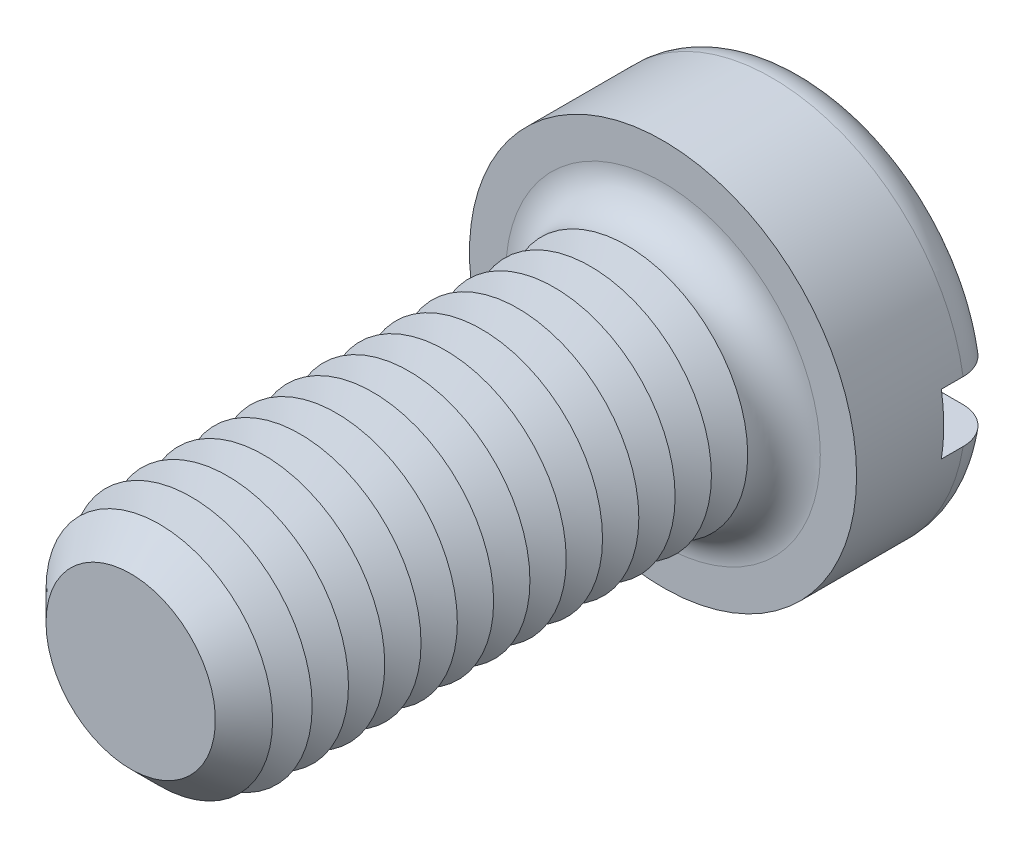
ISO-10303-21;
HEADER;
FILE_DESCRIPTION(('STEP AP214'),'2;1');
FILE_NAME('part.step','',(''),(''),'','','');
FILE_SCHEMA(('AUTOMOTIVE_DESIGN { 1 0 10303 214 1 1 1 1 }'));
ENDSEC;
DATA;
#1=APPLICATION_CONTEXT('core data for automotive mechanical design processes');
#2=APPLICATION_PROTOCOL_DEFINITION('international standard','automotive_design',2000,#1);
#3=PRODUCT_CONTEXT('',#1,'mechanical');
#4=PRODUCT('Part','Part','',(#3));
#5=PRODUCT_RELATED_PRODUCT_CATEGORY('part','',(#4));
#6=PRODUCT_DEFINITION_FORMATION('','',#4);
#7=PRODUCT_DEFINITION_CONTEXT('part definition',#1,'design');
#8=PRODUCT_DEFINITION('design','',#6,#7);
#9=PRODUCT_DEFINITION_SHAPE('','',#8);
#10=(LENGTH_UNIT() NAMED_UNIT(*) SI_UNIT(.MILLI.,.METRE.));
#11=(NAMED_UNIT(*) PLANE_ANGLE_UNIT() SI_UNIT($,.RADIAN.));
#12=(NAMED_UNIT(*) SI_UNIT($,.STERADIAN.) SOLID_ANGLE_UNIT());
#13=UNCERTAINTY_MEASURE_WITH_UNIT(LENGTH_MEASURE(1.E-05),#10,'distance_accuracy_value','');
#14=(GEOMETRIC_REPRESENTATION_CONTEXT(3) GLOBAL_UNCERTAINTY_ASSIGNED_CONTEXT((#13)) GLOBAL_UNIT_ASSIGNED_CONTEXT((#10,
#11,#12)) REPRESENTATION_CONTEXT('',''));
#15=CARTESIAN_POINT('',(0.,0.,0.));
#16=DIRECTION('',(0.,0.,1.));
#17=DIRECTION('',(1.,0.,0.));
#18=AXIS2_PLACEMENT_3D('',#15,#16,#17);
#19=CARTESIAN_POINT('',(0.,0.,-6.));
#20=DIRECTION('',(0.,0.,1.));
#21=DIRECTION('',(1.,0.,0.));
#22=AXIS2_PLACEMENT_3D('',#19,#20,#21);
#23=PLANE('',#22);
#24=CARTESIAN_POINT('',(0.,0.,-6.));
#25=DIRECTION('',(0.,0.,1.));
#26=DIRECTION('',(1.,0.,0.));
#27=AXIS2_PLACEMENT_3D('',#24,#25,#26);
#28=CIRCLE('',#27,6.5);
#29=CARTESIAN_POINT('',(-6.37867541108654,1.25,-6.));
#30=VERTEX_POINT('',#29);
#31=CARTESIAN_POINT('',(6.37867541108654,1.25,-6.));
#32=VERTEX_POINT('',#31);
#33=EDGE_CURVE('E116',#30,#32,#28,.F.);
#34=ORIENTED_EDGE('',*,*,#33,.T.);
#35=DIRECTION('',(1.,0.,0.));
#36=VECTOR('',#35,1.);
#37=CARTESIAN_POINT('',(-8.,1.25,-6.));
#38=LINE('',#37,#36);
#39=EDGE_CURVE('E111',#30,#32,#38,.T.);
#40=ORIENTED_EDGE('',*,*,#39,.F.);
#41=EDGE_LOOP('',(#34,#40));
#42=FACE_BOUND('',#41,.T.);
#43=ADVANCED_FACE('F39',(#42),#23,.F.);
#44=CARTESIAN_POINT('',(0.,0.,-4.5));
#45=DIRECTION('',(0.,0.,1.));
#46=DIRECTION('',(1.,0.,0.));
#47=AXIS2_PLACEMENT_3D('',#44,#45,#46);
#48=TOROIDAL_SURFACE('',#47,6.5,1.5);
#49=CARTESIAN_POINT('',(-7.63778128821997,1.25,-5.34492908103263));
#50=CARTESIAN_POINT('',(-7.58949199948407,1.25,-5.41482553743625));
#51=CARTESIAN_POINT('',(-7.53520056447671,1.25,-5.48065698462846));
#52=CARTESIAN_POINT('',(-7.41624971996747,1.25,-5.60228223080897));
#53=CARTESIAN_POINT('',(-7.35157642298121,1.25,-5.65806236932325));
#54=CARTESIAN_POINT('',(-7.21387612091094,1.25,-5.75795436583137));
#55=CARTESIAN_POINT('',(-7.14085828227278,1.25,-5.80207885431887));
#56=CARTESIAN_POINT('',(-6.98853766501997,1.25,-5.87758013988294));
#57=CARTESIAN_POINT('',(-6.90923642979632,1.25,-5.90896005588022));
#58=CARTESIAN_POINT('',(-6.74565677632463,1.25,-5.95849861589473));
#59=CARTESIAN_POINT('',(-6.66133328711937,1.25,-5.97650838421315));
#60=CARTESIAN_POINT('',(-6.49086565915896,1.25,-5.99833509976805));
#61=CARTESIAN_POINT('',(-6.40472129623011,1.25,-6.00215028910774));
#62=CARTESIAN_POINT('',(-6.23174891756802,1.25,-5.99550457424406));
#63=CARTESIAN_POINT('',(-6.14492874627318,1.25,-5.98483870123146));
#64=CARTESIAN_POINT('',(-5.97427268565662,1.25,-5.94920077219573));
#65=CARTESIAN_POINT('',(-5.89043699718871,1.25,-5.92422775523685));
#66=CARTESIAN_POINT('',(-5.72747580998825,1.25,-5.86041051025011));
#67=CARTESIAN_POINT('',(-5.64839123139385,1.25,-5.8214616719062));
#68=CARTESIAN_POINT('',(-5.49793182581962,1.25,-5.73076137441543));
#69=CARTESIAN_POINT('',(-5.42655700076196,1.25,-5.6790099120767));
#70=CARTESIAN_POINT('',(-5.29410028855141,1.25,-5.56444713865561));
#71=CARTESIAN_POINT('',(-5.23295591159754,1.25,-5.50170815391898));
#72=CARTESIAN_POINT('',(-5.12236155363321,1.25,-5.36664720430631));
#73=CARTESIAN_POINT('',(-5.07291010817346,1.25,-5.29432644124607));
#74=CARTESIAN_POINT('',(-4.98836421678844,1.25,-5.14389152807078));
#75=CARTESIAN_POINT('',(-4.95296843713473,1.25,-5.0659468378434));
#76=CARTESIAN_POINT('',(-4.89620356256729,1.25,-4.90510804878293));
#77=CARTESIAN_POINT('',(-4.87483169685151,1.25,-4.82221493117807));
#78=CARTESIAN_POINT('',(-4.8472995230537,1.25,-4.65636387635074));
#79=CARTESIAN_POINT('',(-4.84072446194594,1.25,-4.57347463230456));
#80=CARTESIAN_POINT('',(-4.84179430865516,1.25,-4.40779255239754));
#81=CARTESIAN_POINT('',(-4.84943782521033,1.25,-4.32499970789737));
#82=CARTESIAN_POINT('',(-4.87846819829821,1.25,-4.16301415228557));
#83=CARTESIAN_POINT('',(-4.89966978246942,1.25,-4.08378809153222));
#84=CARTESIAN_POINT('',(-4.95491528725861,1.25,-3.92995334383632));
#85=CARTESIAN_POINT('',(-4.98895983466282,1.25,-3.85534488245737));
#86=CARTESIAN_POINT('',(-5.06928242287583,1.25,-3.71183790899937));
#87=CARTESIAN_POINT('',(-5.11570495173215,1.25,-3.64302036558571));
#88=CARTESIAN_POINT('',(-5.21915370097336,1.25,-3.51388372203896));
#89=CARTESIAN_POINT('',(-5.27618132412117,1.25,-3.45356574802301));
#90=CARTESIAN_POINT('',(-5.40090076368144,1.25,-3.34137671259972));
#91=CARTESIAN_POINT('',(-5.46884305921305,1.25,-3.28978408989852));
#92=CARTESIAN_POINT('',(-5.61225757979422,1.25,-3.19841811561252));
#93=CARTESIAN_POINT('',(-5.68773079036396,1.25,-3.15864631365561));
#94=CARTESIAN_POINT('',(-5.84602026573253,1.25,-3.09111626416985));
#95=CARTESIAN_POINT('',(-5.92896901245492,1.25,-3.06366820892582));
#96=CARTESIAN_POINT('',(-6.09827849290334,1.25,-3.02294686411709));
#97=CARTESIAN_POINT('',(-6.18463944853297,1.25,-3.00967449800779));
#98=CARTESIAN_POINT('',(-6.35914138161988,1.25,-2.99765063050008));
#99=CARTESIAN_POINT('',(-6.4472913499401,1.25,-2.99902877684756));
#100=CARTESIAN_POINT('',(-6.62209547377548,1.25,-3.01665363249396));
#101=CARTESIAN_POINT('',(-6.70874965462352,1.25,-3.03290008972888));
#102=CARTESIAN_POINT('',(-6.87754008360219,1.25,-3.07975247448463));
#103=CARTESIAN_POINT('',(-6.95969991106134,1.25,-3.11027336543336));
#104=CARTESIAN_POINT('',(-7.11762200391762,1.25,-3.18486653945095));
#105=CARTESIAN_POINT('',(-7.19338469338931,1.25,-3.22893792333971));
#106=CARTESIAN_POINT('',(-7.33522754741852,1.25,-3.32873457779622));
#107=CARTESIAN_POINT('',(-7.40142768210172,1.25,-3.38428930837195));
#108=CARTESIAN_POINT('',(-7.52338344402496,1.25,-3.50587739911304));
#109=CARTESIAN_POINT('',(-7.5791399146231,1.25,-3.57190991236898));
#110=CARTESIAN_POINT('',(-7.67774856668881,1.25,-3.71151097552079));
#111=CARTESIAN_POINT('',(-7.72078137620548,1.25,-3.7849519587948));
#112=CARTESIAN_POINT('',(-7.79373860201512,1.25,-3.93807617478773));
#113=CARTESIAN_POINT('',(-7.82366445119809,1.25,-4.01775872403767));
#114=CARTESIAN_POINT('',(-7.86922494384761,1.25,-4.1801114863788));
#115=CARTESIAN_POINT('',(-7.88502105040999,1.25,-4.26273642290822));
#116=CARTESIAN_POINT('',(-7.90243332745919,1.25,-4.42948977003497));
#117=CARTESIAN_POINT('',(-7.90404643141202,1.25,-4.51361850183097));
#118=CARTESIAN_POINT('',(-7.89306914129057,1.25,-4.68049925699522));
#119=CARTESIAN_POINT('',(-7.88055163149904,1.25,-4.76325613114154));
#120=CARTESIAN_POINT('',(-7.84181179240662,1.25,-4.92542124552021));
#121=CARTESIAN_POINT('',(-7.81560657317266,1.25,-5.00483353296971));
#122=CARTESIAN_POINT('',(-7.76329893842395,1.25,-5.12766777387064));
#123=CARTESIAN_POINT('',(-7.74127773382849,1.25,-5.17287245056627));
#124=CARTESIAN_POINT('',(-7.69279783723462,1.25,-5.26083500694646));
#125=CARTESIAN_POINT('',(-7.66633917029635,1.25,-5.30359290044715));
#126=CARTESIAN_POINT('',(-7.63778128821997,1.25,-5.34492908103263));
#127=B_SPLINE_CURVE_WITH_KNOTS('',3,(#49,#50,#51,#52,#53,#54,#55,#56,#57,#58,#59,#60,#61,#62,
#63,#64,#65,#66,#67,#68,#69,#70,#71,#72,#73,#74,#75,#76,#77,#78,#79,#80,#81,#82,#83,#84,#85,#86,
#87,#88,#89,#90,#91,#92,#93,#94,#95,#96,#97,#98,#99,#100,#101,#102,#103,#104,#105,#106,#107,
#108,#109,#110,#111,#112,#113,#114,#115,#116,#117,#118,#119,#120,#121,#122,#123,#124,#125,#126),
.UNSPECIFIED.,.T.,.F.,(4,2,2,2,2,2,2,2,2,2,2,2,2,2,2,2,2,2,2,2,2,2,2,2,2,2,2,2,2,2,2,2,2,2,2,2,
2,2,4),(0.,0.254678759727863,0.509701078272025,0.764445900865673,1.01912834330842,
1.27660578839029,1.53411511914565,1.7953075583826,2.05651754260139,2.31972495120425,
2.58293242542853,2.84446831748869,3.10597143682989,3.36151874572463,3.61701554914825,
3.86525656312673,4.11347328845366,4.35836855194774,4.60327576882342,4.8511774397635,
5.0991119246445,5.35387584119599,5.60867314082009,5.86956650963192,6.13047687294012,
6.39369803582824,6.65691473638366,6.91858297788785,7.18023385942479,7.43824706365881,
7.69623942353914,7.95037087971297,8.20447454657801,8.45563599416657,8.70685174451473,
8.95677764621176,9.20639187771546,9.35700761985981,9.50762251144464),.UNSPECIFIED.);
#128=CARTESIAN_POINT('',(-7.90174031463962,1.25,-4.50000000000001));
#129=VERTEX_POINT('',#128);
#130=EDGE_CURVE('E289',#129,#30,#127,.T.);
#131=ORIENTED_EDGE('',*,*,#130,.F.);
#132=CARTESIAN_POINT('',(0.,0.,-4.5));
#133=DIRECTION('',(0.,0.,1.));
#134=DIRECTION('',(1.,0.,0.));
#135=AXIS2_PLACEMENT_3D('',#132,#133,#134);
#136=CIRCLE('',#135,8.);
#137=CARTESIAN_POINT('',(7.90174031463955,1.25,-4.5));
#138=VERTEX_POINT('',#137);
#139=EDGE_CURVE('E125',#138,#129,#136,.T.);
#140=ORIENTED_EDGE('',*,*,#139,.F.);
#141=CARTESIAN_POINT('',(4.95236709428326,1.25,-5.05808354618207));
#142=CARTESIAN_POINT('',(4.98477386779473,1.25,-5.13646278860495));
#143=CARTESIAN_POINT('',(5.02397623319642,1.25,-5.21210974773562));
#144=CARTESIAN_POINT('',(5.11464829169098,1.25,-5.35575180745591));
#145=CARTESIAN_POINT('',(5.16613670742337,1.25,-5.42373499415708));
#146=CARTESIAN_POINT('',(5.27963080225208,1.25,-5.55005899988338));
#147=CARTESIAN_POINT('',(5.34161871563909,1.25,-5.60841578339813));
#148=CARTESIAN_POINT('',(5.47431803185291,1.25,-5.71412381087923));
#149=CARTESIAN_POINT('',(5.545027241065,1.25,-5.76147781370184));
#150=CARTESIAN_POINT('',(5.69469818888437,1.25,-5.84486022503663));
#151=CARTESIAN_POINT('',(5.77379661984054,1.25,-5.88064336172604));
#152=CARTESIAN_POINT('',(5.93682776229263,1.25,-5.93863952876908));
#153=CARTESIAN_POINT('',(6.02076112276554,1.25,-5.96085073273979));
#154=CARTESIAN_POINT('',(6.19235911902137,1.25,-5.99130732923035));
#155=CARTESIAN_POINT('',(6.2800597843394,1.25,-5.99935025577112));
#156=CARTESIAN_POINT('',(6.45556807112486,1.25,-6.00057400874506));
#157=CARTESIAN_POINT('',(6.54337569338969,1.25,-5.99375472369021));
#158=CARTESIAN_POINT('',(6.71642471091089,1.25,-5.96539034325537));
#159=CARTESIAN_POINT('',(6.8016703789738,1.25,-5.94387137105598));
#160=CARTESIAN_POINT('',(6.96726399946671,1.25,-5.8866508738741));
#161=CARTESIAN_POINT('',(7.04761223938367,1.25,-5.85095018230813));
#162=CARTESIAN_POINT('',(7.2000703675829,1.25,-5.7668235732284));
#163=CARTESIAN_POINT('',(7.27226868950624,1.25,-5.71855796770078));
#164=CARTESIAN_POINT('',(7.40737382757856,1.25,-5.61041520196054));
#165=CARTESIAN_POINT('',(7.47028138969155,1.25,-5.55053897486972));
#166=CARTESIAN_POINT('',(7.5840004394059,1.25,-5.42185995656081));
#167=CARTESIAN_POINT('',(7.63498189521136,1.25,-5.35320736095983));
#168=CARTESIAN_POINT('',(7.72451646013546,1.25,-5.20822613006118));
#169=CARTESIAN_POINT('',(7.76307051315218,1.25,-5.13189807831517));
#170=CARTESIAN_POINT('',(7.82615156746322,1.25,-4.97479919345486));
#171=CARTESIAN_POINT('',(7.85085353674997,1.25,-4.89409858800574));
#172=CARTESIAN_POINT('',(7.88624162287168,1.25,-4.72968126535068));
#173=CARTESIAN_POINT('',(7.89692844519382,1.25,-4.64596470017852));
#174=CARTESIAN_POINT('',(7.90393395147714,1.25,-4.47857496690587));
#175=CARTESIAN_POINT('',(7.900361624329,1.25,-4.39490633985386));
#176=CARTESIAN_POINT('',(7.8792027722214,1.25,-4.22936201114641));
#177=CARTESIAN_POINT('',(7.86161649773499,1.25,-4.14748627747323));
#178=CARTESIAN_POINT('',(7.81298565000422,1.25,-3.98793539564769));
#179=CARTESIAN_POINT('',(7.78195585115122,1.25,-3.91025574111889));
#180=CARTESIAN_POINT('',(7.70736418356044,1.25,-3.76116938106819));
#181=CARTESIAN_POINT('',(7.66380211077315,1.25,-3.68976277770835));
#182=CARTESIAN_POINT('',(7.56515173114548,1.25,-3.55480889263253));
#183=CARTESIAN_POINT('',(7.51000119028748,1.25,-3.49130712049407));
#184=CARTESIAN_POINT('',(7.38992820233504,1.25,-3.3743390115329));
#185=CARTESIAN_POINT('',(7.32500529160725,1.25,-3.32087315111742));
#186=CARTESIAN_POINT('',(7.18646521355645,1.25,-3.22483712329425));
#187=CARTESIAN_POINT('',(7.11275872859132,1.25,-3.18239583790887));
#188=CARTESIAN_POINT('',(6.95934489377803,1.25,-3.11028530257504));
#189=CARTESIAN_POINT('',(6.87963710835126,1.25,-3.08061698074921));
#190=CARTESIAN_POINT('',(6.71523243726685,1.25,-3.03442872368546));
#191=CARTESIAN_POINT('',(6.63047940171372,1.25,-3.0181086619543));
#192=CARTESIAN_POINT('',(6.45944163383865,1.25,-2.99971307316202));
#193=CARTESIAN_POINT('',(6.37315677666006,1.25,-2.99763871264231));
#194=CARTESIAN_POINT('',(6.20021063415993,1.25,-3.00779604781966));
#195=CARTESIAN_POINT('',(6.11356117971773,1.25,-3.02022976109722));
#196=CARTESIAN_POINT('',(5.94354092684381,1.25,-3.05935975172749));
#197=CARTESIAN_POINT('',(5.86017035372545,1.25,-3.08605700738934));
#198=CARTESIAN_POINT('',(5.69848536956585,1.25,-3.15322746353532));
#199=CARTESIAN_POINT('',(5.62021039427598,1.25,-3.1937956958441));
#200=CARTESIAN_POINT('',(5.47164170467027,1.25,-3.28758816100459));
#201=CARTESIAN_POINT('',(5.40134797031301,1.25,-3.3408123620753));
#202=CARTESIAN_POINT('',(5.27136483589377,1.25,-3.45806317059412));
#203=CARTESIAN_POINT('',(5.21160120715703,1.25,-3.52200740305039));
#204=CARTESIAN_POINT('',(5.10396941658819,1.25,-3.65922833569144));
#205=CARTESIAN_POINT('',(5.05609917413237,1.25,-3.73250340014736));
#206=CARTESIAN_POINT('',(4.97487058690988,1.25,-3.8844714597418));
#207=CARTESIAN_POINT('',(4.94119529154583,1.25,-3.96299495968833));
#208=CARTESIAN_POINT('',(4.88793322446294,1.25,-4.12470694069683));
#209=CARTESIAN_POINT('',(4.86834741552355,1.25,-4.20789574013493));
#210=CARTESIAN_POINT('',(4.84433446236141,1.25,-4.3740749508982));
#211=CARTESIAN_POINT('',(4.83950391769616,1.25,-4.45700748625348));
#212=CARTESIAN_POINT('',(4.84404021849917,1.25,-4.62240731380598));
#213=CARTESIAN_POINT('',(4.85338770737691,1.25,-4.70487508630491));
#214=CARTESIAN_POINT('',(4.87895619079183,1.25,-4.83246978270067));
#215=CARTESIAN_POINT('',(4.89056704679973,1.25,-4.87856970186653));
#216=CARTESIAN_POINT('',(4.91819711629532,1.25,-4.96942661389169));
#217=CARTESIAN_POINT('',(4.93421619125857,1.25,-5.01418364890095));
#218=CARTESIAN_POINT('',(4.95236709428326,1.25,-5.05808354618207));
#219=B_SPLINE_CURVE_WITH_KNOTS('',3,(#141,#142,#143,#144,#145,#146,#147,#148,#149,#150,#151,
#152,#153,#154,#155,#156,#157,#158,#159,#160,#161,#162,#163,#164,#165,#166,#167,#168,#169,#170,
#171,#172,#173,#174,#175,#176,#177,#178,#179,#180,#181,#182,#183,#184,#185,#186,#187,#188,#189,
#190,#191,#192,#193,#194,#195,#196,#197,#198,#199,#200,#201,#202,#203,#204,#205,#206,#207,#208,
#209,#210,#211,#212,#213,#214,#215,#216,#217,#218),.UNSPECIFIED.,.T.,.F.,(4,2,2,2,2,2,2,2,2,2,2,
2,2,2,2,2,2,2,2,2,2,2,2,2,2,2,2,2,2,2,2,2,2,2,2,2,2,2,4),(0.,0.25426396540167,0.508917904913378,
0.763145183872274,1.01730864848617,1.27655188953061,1.53583000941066,1.79878406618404,
2.06174009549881,2.32423003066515,2.5867045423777,2.84598168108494,3.10523799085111,
3.36053725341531,3.61581712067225,3.8677953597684,4.11976091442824,4.36980428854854,
4.61984319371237,4.86960800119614,5.11937687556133,5.37052303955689,5.62168112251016,
5.87565515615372,6.12964764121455,6.38737709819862,6.64512765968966,6.90651052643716,
7.16791132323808,7.43114013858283,7.69436829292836,7.95565940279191,8.21690477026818,
8.47196060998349,8.72703387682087,8.97506819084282,9.22276418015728,9.36518087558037,
9.50759309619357),.UNSPECIFIED.);
#220=EDGE_CURVE('E291',#32,#138,#219,.T.);
#221=ORIENTED_EDGE('',*,*,#220,.F.);
#222=ORIENTED_EDGE('',*,*,#33,.F.);
#223=EDGE_LOOP('',(#131,#140,#221,#222));
#224=FACE_BOUND('',#223,.T.);
#225=ADVANCED_FACE('F273',(#224),#48,.T.);
#226=CARTESIAN_POINT('',(0.,0.,-6.));
#227=DIRECTION('',(0.,0.,1.));
#228=DIRECTION('',(1.,0.,0.));
#229=AXIS2_PLACEMENT_3D('',#226,#227,#228);
#230=CYLINDRICAL_SURFACE('',#229,8.);
#231=DIRECTION('',(0.,0.,1.));
#232=VECTOR('',#231,1.);
#233=CARTESIAN_POINT('',(7.90174031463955,1.25,-6.));
#234=LINE('',#233,#232);
#235=CARTESIAN_POINT('',(7.90174031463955,1.25,-3.6));
#236=VERTEX_POINT('',#235);
#237=EDGE_CURVE('E307',#138,#236,#234,.T.);
#238=ORIENTED_EDGE('',*,*,#237,.F.);
#239=ORIENTED_EDGE('',*,*,#139,.T.);
#240=DIRECTION('',(0.,0.,1.));
#241=VECTOR('',#240,1.);
#242=CARTESIAN_POINT('',(-7.90174031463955,1.25,-6.));
#243=LINE('',#242,#241);
#244=CARTESIAN_POINT('',(-7.90174031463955,1.25,-3.6));
#245=VERTEX_POINT('',#244);
#246=EDGE_CURVE('E63',#245,#129,#243,.F.);
#247=ORIENTED_EDGE('',*,*,#246,.F.);
#248=CARTESIAN_POINT('',(0.,0.,-3.6));
#249=DIRECTION('',(0.,0.,-1.));
#250=DIRECTION('',(-1.,0.,0.));
#251=AXIS2_PLACEMENT_3D('',#248,#249,#250);
#252=CIRCLE('',#251,8.);
#253=CARTESIAN_POINT('',(-7.90174031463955,-1.25,-3.6));
#254=VERTEX_POINT('',#253);
#255=EDGE_CURVE('E43',#245,#254,#252,.F.);
#256=ORIENTED_EDGE('',*,*,#255,.T.);
#257=DIRECTION('',(0.,0.,1.));
#258=VECTOR('',#257,1.);
#259=CARTESIAN_POINT('',(-7.90174031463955,-1.25,-6.));
#260=LINE('',#259,#258);
#261=CARTESIAN_POINT('',(-7.9017403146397,-1.25,-4.49999999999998));
#262=VERTEX_POINT('',#261);
#263=EDGE_CURVE('E304',#262,#254,#260,.T.);
#264=ORIENTED_EDGE('',*,*,#263,.F.);
#265=CARTESIAN_POINT('',(7.90174031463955,-1.25,-4.5));
#266=VERTEX_POINT('',#265);
#267=EDGE_CURVE('E127',#262,#266,#136,.T.);
#268=ORIENTED_EDGE('',*,*,#267,.T.);
#269=DIRECTION('',(0.,0.,1.));
#270=VECTOR('',#269,1.);
#271=CARTESIAN_POINT('',(7.90174031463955,-1.25,-6.));
#272=LINE('',#271,#270);
#273=CARTESIAN_POINT('',(7.90174031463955,-1.25,-3.6));
#274=VERTEX_POINT('',#273);
#275=EDGE_CURVE('E55',#274,#266,#272,.F.);
#276=ORIENTED_EDGE('',*,*,#275,.F.);
#277=EDGE_CURVE('E11',#274,#236,#252,.F.);
#278=ORIENTED_EDGE('',*,*,#277,.T.);
#279=EDGE_LOOP('',(#238,#239,#247,#256,#264,#268,#276,#278));
#280=FACE_BOUND('',#279,.T.);
#281=CARTESIAN_POINT('',(0.,0.,0.));
#282=DIRECTION('',(0.,0.,1.));
#283=DIRECTION('',(1.,0.,0.));
#284=AXIS2_PLACEMENT_3D('',#281,#282,#283);
#285=CIRCLE('',#284,8.);
#286=CARTESIAN_POINT('',(8.,0.,0.));
#287=VERTEX_POINT('',#286);
#288=EDGE_CURVE('E310',#287,#287,#285,.T.);
#289=ORIENTED_EDGE('',*,*,#288,.F.);
#290=EDGE_LOOP('',(#289));
#291=FACE_BOUND('',#290,.T.);
#292=ADVANCED_FACE('F269',(#280,#291),#230,.T.);
#293=CARTESIAN_POINT('',(6.37867541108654,-1.25,-6.));
#294=VERTEX_POINT('',#293);
#295=CARTESIAN_POINT('',(-6.37867541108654,-1.25,-6.));
#296=VERTEX_POINT('',#295);
#297=EDGE_CURVE('E109',#294,#296,#28,.F.);
#298=ORIENTED_EDGE('',*,*,#297,.T.);
#299=DIRECTION('',(-1.,0.,0.));
#300=VECTOR('',#299,1.);
#301=CARTESIAN_POINT('',(-8.,-1.25,-6.));
#302=LINE('',#301,#300);
#303=EDGE_CURVE('E96',#294,#296,#302,.T.);
#304=ORIENTED_EDGE('',*,*,#303,.F.);
#305=EDGE_LOOP('',(#298,#304));
#306=FACE_BOUND('',#305,.T.);
#307=ADVANCED_FACE('F108',(#306),#23,.F.);
#308=CARTESIAN_POINT('',(0.,0.,0.));
#309=DIRECTION('',(0.,0.,1.));
#310=DIRECTION('',(1.,0.,0.));
#311=AXIS2_PLACEMENT_3D('',#308,#309,#310);
#312=PLANE('',#311);
#313=CARTESIAN_POINT('',(0.,0.,0.));
#314=DIRECTION('',(0.,0.,1.));
#315=DIRECTION('',(1.,0.,0.));
#316=AXIS2_PLACEMENT_3D('',#313,#314,#315);
#317=CIRCLE('',#316,6.5);
#318=CARTESIAN_POINT('',(6.5,0.,0.));
#319=VERTEX_POINT('',#318);
#320=EDGE_CURVE('E115',#319,#319,#317,.F.);
#321=ORIENTED_EDGE('',*,*,#320,.T.);
#322=EDGE_LOOP('',(#321));
#323=FACE_BOUND('',#322,.T.);
#324=ORIENTED_EDGE('',*,*,#288,.T.);
#325=EDGE_LOOP('',(#324));
#326=FACE_BOUND('',#325,.T.);
#327=ADVANCED_FACE('F268',(#323,#326),#312,.T.);
#328=CARTESIAN_POINT('',(-7.63778128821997,-1.25,-5.34492908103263));
#329=CARTESIAN_POINT('',(-7.68527581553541,-1.25,-5.27616964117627));
#330=CARTESIAN_POINT('',(-7.72703224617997,-1.25,-5.20337764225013));
#331=CARTESIAN_POINT('',(-7.79778035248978,-1.25,-5.05176511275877));
#332=CARTESIAN_POINT('',(-7.82675823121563,-1.25,-4.97293817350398));
#333=CARTESIAN_POINT('',(-7.87103239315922,-1.25,-4.81153865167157));
#334=CARTESIAN_POINT('',(-7.8863313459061,-1.25,-4.72896680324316));
#335=CARTESIAN_POINT('',(-7.90278562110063,-1.25,-4.56244566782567));
#336=CARTESIAN_POINT('',(-7.90394420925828,-1.25,-4.4784967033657));
#337=CARTESIAN_POINT('',(-7.89211470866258,-1.25,-4.31190980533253));
#338=CARTESIAN_POINT('',(-7.87917806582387,-1.25,-4.22926821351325));
#339=CARTESIAN_POINT('',(-7.8396278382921,-1.25,-4.06732477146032));
#340=CARTESIAN_POINT('',(-7.81301388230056,-1.25,-3.98802301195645));
#341=CARTESIAN_POINT('',(-7.74686575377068,-1.25,-3.83490116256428));
#342=CARTESIAN_POINT('',(-7.70731700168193,-1.25,-3.76108737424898));
#343=CARTESIAN_POINT('',(-7.61647675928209,-1.25,-3.62108231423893));
#344=CARTESIAN_POINT('',(-7.56518496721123,-1.25,-3.55489123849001));
#345=CARTESIAN_POINT('',(-7.45192141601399,-1.25,-3.43145488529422));
#346=CARTESIAN_POINT('',(-7.3898717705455,-1.25,-3.37428109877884));
#347=CARTESIAN_POINT('',(-7.25715883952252,-1.25,-3.27100737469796));
#348=CARTESIAN_POINT('',(-7.18649507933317,-1.25,-3.22490804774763));
#349=CARTESIAN_POINT('',(-7.03760898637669,-1.25,-3.14445316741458));
#350=CARTESIAN_POINT('',(-6.95930204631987,-1.25,-3.1102542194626));
#351=CARTESIAN_POINT('',(-6.79811453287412,-1.25,-3.05526915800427));
#352=CARTESIAN_POINT('',(-6.71523359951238,-1.25,-3.03448410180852));
#353=CARTESIAN_POINT('',(-6.5459165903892,-1.25,-3.006592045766));
#354=CARTESIAN_POINT('',(-6.45944575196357,-1.25,-2.99969602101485));
#355=CARTESIAN_POINT('',(-6.28655568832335,-1.25,-3.00032465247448));
#356=CARTESIAN_POINT('',(-6.20013646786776,-1.25,-3.00785047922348));
#357=CARTESIAN_POINT('',(-6.02865505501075,-1.25,-3.03725742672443));
#358=CARTESIAN_POINT('',(-5.94362352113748,-1.25,-3.05931758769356));
#359=CARTESIAN_POINT('',(-5.77844448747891,-1.25,-3.11735373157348));
#360=CARTESIAN_POINT('',(-5.69829723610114,-1.25,-3.15333042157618));
#361=CARTESIAN_POINT('',(-5.54495924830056,-1.25,-3.23837037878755));
#362=CARTESIAN_POINT('',(-5.47178958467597,-1.25,-3.28747168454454));
#363=CARTESIAN_POINT('',(-5.33486536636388,-1.25,-3.39741183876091));
#364=CARTESIAN_POINT('',(-5.27111040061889,-1.25,-3.45825017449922));
#365=CARTESIAN_POINT('',(-5.15579778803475,-1.25,-3.58914722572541));
#366=CARTESIAN_POINT('',(-5.10409113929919,-1.25,-3.65907455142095));
#367=CARTESIAN_POINT('',(-5.01353659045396,-1.25,-3.8068142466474));
#368=CARTESIAN_POINT('',(-4.97468647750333,-1.25,-3.88462525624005));
#369=CARTESIAN_POINT('',(-4.91208858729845,-1.25,-4.04366636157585));
#370=CARTESIAN_POINT('',(-4.88795969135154,-1.25,-4.12474643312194));
#371=CARTESIAN_POINT('',(-4.85404909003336,-1.25,-4.28985038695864));
#372=CARTESIAN_POINT('',(-4.84426486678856,-1.25,-4.37387374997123));
#373=CARTESIAN_POINT('',(-4.83946276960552,-1.25,-4.54023897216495));
#374=CARTESIAN_POINT('',(-4.8440833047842,-1.25,-4.62257060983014));
#375=CARTESIAN_POINT('',(-4.86713763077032,-1.25,-4.78527148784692));
#376=CARTESIAN_POINT('',(-4.88557092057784,-1.25,-4.86564079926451));
#377=CARTESIAN_POINT('',(-4.9355229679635,-1.25,-5.02189555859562));
#378=CARTESIAN_POINT('',(-4.9669975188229,-1.25,-5.09779517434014));
#379=CARTESIAN_POINT('',(-5.04199393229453,-1.25,-5.24338322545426));
#380=CARTESIAN_POINT('',(-5.0855168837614,-1.25,-5.31307109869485));
#381=CARTESIAN_POINT('',(-5.18427540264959,-1.25,-5.44580979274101));
#382=CARTESIAN_POINT('',(-5.2397318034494,-1.25,-5.50869620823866));
#383=CARTESIAN_POINT('',(-5.36015301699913,-1.25,-5.62458635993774));
#384=CARTESIAN_POINT('',(-5.42511919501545,-1.25,-5.67758867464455));
#385=CARTESIAN_POINT('',(-5.56469412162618,-1.25,-5.7737610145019));
#386=CARTESIAN_POINT('',(-5.6395232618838,-1.25,-5.81661133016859));
#387=CARTESIAN_POINT('',(-5.79521544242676,-1.25,-5.8894110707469));
#388=CARTESIAN_POINT('',(-5.8760791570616,-1.25,-5.91935905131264));
#389=CARTESIAN_POINT('',(-6.04317815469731,-1.25,-5.9660059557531));
#390=CARTESIAN_POINT('',(-6.12948555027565,-1.25,-5.98244700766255));
#391=CARTESIAN_POINT('',(-6.30363462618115,-1.25,-6.00064866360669));
#392=CARTESIAN_POINT('',(-6.39147629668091,-1.25,-6.00240936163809));
#393=CARTESIAN_POINT('',(-6.5664192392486,-1.25,-5.9911248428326));
#394=CARTESIAN_POINT('',(-6.653518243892,-1.25,-5.9780442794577));
#395=CARTESIAN_POINT('',(-6.82426167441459,-1.25,-5.93729204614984));
#396=CARTESIAN_POINT('',(-6.90790538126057,-1.25,-5.90961735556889));
#397=CARTESIAN_POINT('',(-7.06846412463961,-1.25,-5.84071272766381));
#398=CARTESIAN_POINT('',(-7.14543542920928,-1.25,-5.79961377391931));
#399=CARTESIAN_POINT('',(-7.29116896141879,-1.25,-5.70491210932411));
#400=CARTESIAN_POINT('',(-7.35994165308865,-1.25,-5.65132560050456));
#401=CARTESIAN_POINT('',(-7.46362894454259,-1.25,-5.55509815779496));
#402=CARTESIAN_POINT('',(-7.50165191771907,-1.25,-5.51575032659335));
#403=CARTESIAN_POINT('',(-7.57319530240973,-1.25,-5.43315308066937));
#404=CARTESIAN_POINT('',(-7.60671575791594,-1.25,-5.38990370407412));
#405=CARTESIAN_POINT('',(-7.63778128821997,-1.25,-5.34492908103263));
#406=B_SPLINE_CURVE_WITH_KNOTS('',3,(#328,#329,#330,#331,#332,#333,#334,#335,#336,#337,#338,
#339,#340,#341,#342,#343,#344,#345,#346,#347,#348,#349,#350,#351,#352,#353,#354,#355,#356,#357,
#358,#359,#360,#361,#362,#363,#364,#365,#366,#367,#368,#369,#370,#371,#372,#373,#374,#375,#376,
#377,#378,#379,#380,#381,#382,#383,#384,#385,#386,#387,#388,#389,#390,#391,#392,#393,#394,#395,
#396,#397,#398,#399,#400,#401,#402,#403,#404,#405),.UNSPECIFIED.,.T.,.F.,(4,2,2,2,2,2,2,2,2,2,2,
2,2,2,2,2,2,2,2,2,2,2,2,2,2,2,2,2,2,2,2,2,2,2,2,2,2,2,4),(0.,0.250506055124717,
0.501281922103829,0.752008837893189,1.00267784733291,1.25243500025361,1.50219893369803,
1.75224536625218,2.00229822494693,2.25424343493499,2.50620253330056,2.76136198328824,
3.01654154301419,3.27556891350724,3.53461730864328,3.79691797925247,4.05923197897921,
4.32231463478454,4.5853858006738,4.84500678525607,5.10458306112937,5.3571172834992,
5.60960717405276,5.85581050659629,6.10200490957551,6.34737151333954,6.59276029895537,
6.84315522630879,7.09358613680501,7.35108485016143,7.60861238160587,7.87094926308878,
8.13328446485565,8.39624576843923,8.65926152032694,8.91978401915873,9.17997036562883,
9.34382460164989,9.50767723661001),.UNSPECIFIED.);
#407=EDGE_CURVE('E103',#296,#262,#406,.T.);
#408=ORIENTED_EDGE('',*,*,#407,.F.);
#409=ORIENTED_EDGE('',*,*,#297,.F.);
#410=CARTESIAN_POINT('',(4.95236709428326,-1.25,-5.05808354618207));
#411=CARTESIAN_POINT('',(4.92105512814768,-1.25,-4.98233216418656));
#412=CARTESIAN_POINT('',(4.89604361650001,-1.25,-4.90392040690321));
#413=CARTESIAN_POINT('',(4.85951223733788,-1.25,-4.74395758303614));
#414=CARTESIAN_POINT('',(4.8480045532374,-1.25,-4.66240375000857));
#415=CARTESIAN_POINT('',(4.83891469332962,-1.25,-4.49852199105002));
#416=CARTESIAN_POINT('',(4.84133145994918,-1.25,-4.41619412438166));
#417=CARTESIAN_POINT('',(4.8600038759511,-1.25,-4.25314313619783));
#418=CARTESIAN_POINT('',(4.87625705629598,-1.25,-4.17241973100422));
#419=CARTESIAN_POINT('',(4.92196554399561,-1.25,-4.01505032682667));
#420=CARTESIAN_POINT('',(4.95138456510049,-1.25,-3.93839376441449));
#421=CARTESIAN_POINT('',(5.02244158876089,-1.25,-3.79097367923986));
#422=CARTESIAN_POINT('',(5.06408092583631,-1.25,-3.72021080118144));
#423=CARTESIAN_POINT('',(5.15918188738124,-1.25,-3.5851203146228));
#424=CARTESIAN_POINT('',(5.21285223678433,-1.25,-3.5209397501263));
#425=CARTESIAN_POINT('',(5.32993512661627,-1.25,-3.40218700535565));
#426=CARTESIAN_POINT('',(5.39334903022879,-1.25,-3.34761617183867));
#427=CARTESIAN_POINT('',(5.5300552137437,-1.25,-3.24801679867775));
#428=CARTESIAN_POINT('',(5.60357647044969,-1.25,-3.20330242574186));
#429=CARTESIAN_POINT('',(5.75697062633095,-1.25,-3.1265687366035));
#430=CARTESIAN_POINT('',(5.83684424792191,-1.25,-3.09455086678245));
#431=CARTESIAN_POINT('',(6.00239031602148,-1.25,-3.04353393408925));
#432=CARTESIAN_POINT('',(6.08814636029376,-1.25,-3.02480570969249));
#433=CARTESIAN_POINT('',(6.26158564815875,-1.25,-3.00194915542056));
#434=CARTESIAN_POINT('',(6.34926896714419,-1.25,-2.997821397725));
#435=CARTESIAN_POINT('',(6.52441816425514,-1.25,-3.00435236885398));
#436=CARTESIAN_POINT('',(6.61188199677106,-1.25,-3.01506655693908));
#437=CARTESIAN_POINT('',(6.78373130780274,-1.25,-3.05116556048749));
#438=CARTESIAN_POINT('',(6.8681168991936,-1.25,-3.07654983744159));
#439=CARTESIAN_POINT('',(7.03056473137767,-1.25,-3.14105639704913));
#440=CARTESIAN_POINT('',(7.10867812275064,-1.25,-3.18004978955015));
#441=CARTESIAN_POINT('',(7.25711285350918,-1.25,-3.27078804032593));
#442=CARTESIAN_POINT('',(7.327434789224,-1.25,-3.32253192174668));
#443=CARTESIAN_POINT('',(7.45716954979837,-1.25,-3.4364775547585));
#444=CARTESIAN_POINT('',(7.51672925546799,-1.25,-3.49851206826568));
#445=CARTESIAN_POINT('',(7.62440498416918,-1.25,-3.63182557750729));
#446=CARTESIAN_POINT('',(7.67252193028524,-1.25,-3.70310382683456));
#447=CARTESIAN_POINT('',(7.75523498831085,-1.25,-3.8517825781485));
#448=CARTESIAN_POINT('',(7.79001407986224,-1.25,-3.92908131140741));
#449=CARTESIAN_POINT('',(7.84595474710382,-1.25,-4.08845836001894));
#450=CARTESIAN_POINT('',(7.86711715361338,-1.25,-4.1705363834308));
#451=CARTESIAN_POINT('',(7.89503817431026,-1.25,-4.3362768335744));
#452=CARTESIAN_POINT('',(7.90193595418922,-1.25,-4.41991584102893));
#453=CARTESIAN_POINT('',(7.90153623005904,-1.25,-4.58715860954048));
#454=CARTESIAN_POINT('',(7.89423915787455,-1.25,-4.67076237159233));
#455=CARTESIAN_POINT('',(7.86572271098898,-1.25,-4.83525080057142));
#456=CARTESIAN_POINT('',(7.84455307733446,-1.25,-4.91614410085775));
#457=CARTESIAN_POINT('',(7.78897430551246,-1.25,-5.0732444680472));
#458=CARTESIAN_POINT('',(7.75456511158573,-1.25,-5.1494515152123));
#459=CARTESIAN_POINT('',(7.67339923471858,-1.25,-5.29528903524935));
#460=CARTESIAN_POINT('',(7.62660424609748,-1.25,-5.36489817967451));
#461=CARTESIAN_POINT('',(7.52209201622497,-1.25,-5.49536318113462));
#462=CARTESIAN_POINT('',(7.4643743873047,-1.25,-5.55621872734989));
#463=CARTESIAN_POINT('',(7.33909994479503,-1.25,-5.66807257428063));
#464=CARTESIAN_POINT('',(7.27145672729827,-1.25,-5.71897407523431));
#465=CARTESIAN_POINT('',(7.12868060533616,-1.25,-5.80887807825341));
#466=CARTESIAN_POINT('',(7.0535472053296,-1.25,-5.84787979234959));
#467=CARTESIAN_POINT('',(6.89682225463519,-1.25,-5.91345911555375));
#468=CARTESIAN_POINT('',(6.81515596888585,-1.25,-5.93985808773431));
#469=CARTESIAN_POINT('',(6.64858434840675,-1.25,-5.97879449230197));
#470=CARTESIAN_POINT('',(6.56367874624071,-1.25,-5.99133077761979));
#471=CARTESIAN_POINT('',(6.39168259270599,-1.25,-6.00236627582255));
#472=CARTESIAN_POINT('',(6.30457835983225,-1.25,-6.00065255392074));
#473=CARTESIAN_POINT('',(6.13186422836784,-1.25,-5.98278857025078));
#474=CARTESIAN_POINT('',(6.04625438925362,-1.25,-5.96663773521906));
#475=CARTESIAN_POINT('',(5.87802521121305,-1.25,-5.92012173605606));
#476=CARTESIAN_POINT('',(5.79544617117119,-1.25,-5.88961066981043));
#477=CARTESIAN_POINT('',(5.63656223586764,-1.25,-5.81513349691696));
#478=CARTESIAN_POINT('',(5.56025908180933,-1.25,-5.77116367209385));
#479=CARTESIAN_POINT('',(5.4162607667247,-1.25,-5.67098882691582));
#480=CARTESIAN_POINT('',(5.34855795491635,-1.25,-5.61479480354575));
#481=CARTESIAN_POINT('',(5.22382615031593,-1.25,-5.49168804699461));
#482=CARTESIAN_POINT('',(5.16678340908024,-1.25,-5.42478932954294));
#483=CARTESIAN_POINT('',(5.08326589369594,-1.25,-5.3075481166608));
#484=CARTESIAN_POINT('',(5.05313168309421,-1.25,-5.25976959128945));
#485=CARTESIAN_POINT('',(4.99845900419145,-1.25,-5.16110869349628));
#486=CARTESIAN_POINT('',(4.9739204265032,-1.25,-5.11022638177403));
#487=CARTESIAN_POINT('',(4.95236709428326,-1.25,-5.05808354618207));
#488=B_SPLINE_CURVE_WITH_KNOTS('',3,(#410,#411,#412,#413,#414,#415,#416,#417,#418,#419,#420,
#421,#422,#423,#424,#425,#426,#427,#428,#429,#430,#431,#432,#433,#434,#435,#436,#437,#438,#439,
#440,#441,#442,#443,#444,#445,#446,#447,#448,#449,#450,#451,#452,#453,#454,#455,#456,#457,#458,
#459,#460,#461,#462,#463,#464,#465,#466,#467,#468,#469,#470,#471,#472,#473,#474,#475,#476,#477,
#478,#479,#480,#481,#482,#483,#484,#485,#486,#487),.UNSPECIFIED.,.T.,.F.,(4,2,2,2,2,2,2,2,2,2,2,
2,2,2,2,2,2,2,2,2,2,2,2,2,2,2,2,2,2,2,2,2,2,2,2,2,2,2,4),(0.,0.245701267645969,
0.491624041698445,0.737528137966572,0.983388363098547,1.22857510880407,1.47378864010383,
1.72364048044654,1.97352730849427,2.2304941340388,2.48749022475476,2.74958408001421,
3.01168820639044,3.2747743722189,3.53785088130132,3.79850056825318,4.05913029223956,
4.31587819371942,4.57260537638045,4.82567253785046,5.07872425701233,5.32929532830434,
5.57985877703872,5.82952869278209,6.07919966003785,6.32965199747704,6.58011322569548,
6.8329006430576,7.08570479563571,7.3419930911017,7.59830259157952,7.85844887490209,
8.11860548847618,8.38146435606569,8.64439590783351,8.90709189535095,9.16944670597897,
9.33857644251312,9.5077028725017),.UNSPECIFIED.);
#489=EDGE_CURVE('E92',#266,#294,#488,.T.);
#490=ORIENTED_EDGE('',*,*,#489,.F.);
#491=ORIENTED_EDGE('',*,*,#267,.F.);
#492=EDGE_LOOP('',(#408,#409,#490,#491));
#493=FACE_BOUND('',#492,.T.);
#494=ADVANCED_FACE('F113',(#493),#48,.T.);
#495=CARTESIAN_POINT('',(0.,0.,1.5));
#496=DIRECTION('',(0.,0.,1.));
#497=DIRECTION('',(1.,0.,0.));
#498=AXIS2_PLACEMENT_3D('',#495,#496,#497);
#499=TOROIDAL_SURFACE('',#498,6.5,1.5);
#500=ORIENTED_EDGE('',*,*,#320,.F.);
#501=EDGE_LOOP('',(#500));
#502=FACE_BOUND('',#501,.T.);
#503=CARTESIAN_POINT('',(0.,0.,1.5));
#504=DIRECTION('',(0.,0.,-1.));
#505=DIRECTION('',(-1.,0.,0.));
#506=AXIS2_PLACEMENT_3D('',#503,#504,#505);
#507=CIRCLE('',#506,5.);
#508=CARTESIAN_POINT('',(-5.,0.,1.5));
#509=VERTEX_POINT('',#508);
#510=EDGE_CURVE('E316',#509,#509,#507,.T.);
#511=ORIENTED_EDGE('',*,*,#510,.T.);
#512=EDGE_LOOP('',(#511));
#513=FACE_BOUND('',#512,.T.);
#514=ADVANCED_FACE('F261',(#502,#513),#499,.F.);
#515=CARTESIAN_POINT('',(0.,0.,2.25));
#516=DIRECTION('',(0.,0.,-1.));
#517=DIRECTION('',(-1.,0.,0.));
#518=AXIS2_PLACEMENT_3D('',#515,#516,#517);
#519=CONICAL_SURFACE('',#518,3.70096189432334,1.0471975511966);
#520=ORIENTED_EDGE('',*,*,#510,.F.);
#521=EDGE_LOOP('',(#520));
#522=FACE_BOUND('',#521,.T.);
#523=CARTESIAN_POINT('',(0.,0.,2.25));
#524=DIRECTION('',(0.,0.,-1.));
#525=DIRECTION('',(-1.,0.,0.));
#526=AXIS2_PLACEMENT_3D('',#523,#524,#525);
#527=CIRCLE('',#526,3.70096189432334);
#528=CARTESIAN_POINT('',(-3.70096189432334,0.,2.25));
#529=VERTEX_POINT('',#528);
#530=EDGE_CURVE('E322',#529,#529,#527,.T.);
#531=ORIENTED_EDGE('',*,*,#530,.T.);
#532=EDGE_LOOP('',(#531));
#533=FACE_BOUND('',#532,.T.);
#534=ADVANCED_FACE('F257',(#522,#533),#519,.T.);
#535=CARTESIAN_POINT('',(0.,0.,3.));
#536=DIRECTION('',(0.,0.,1.));
#537=DIRECTION('',(1.,0.,0.));
#538=AXIS2_PLACEMENT_3D('',#535,#536,#537);
#539=CONICAL_SURFACE('',#538,5.,1.0471975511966);
#540=ORIENTED_EDGE('',*,*,#530,.F.);
#541=EDGE_LOOP('',(#540));
#542=FACE_BOUND('',#541,.T.);
#543=CARTESIAN_POINT('',(0.,0.,3.));
#544=DIRECTION('',(0.,0.,-1.));
#545=DIRECTION('',(-1.,0.,0.));
#546=AXIS2_PLACEMENT_3D('',#543,#544,#545);
#547=CIRCLE('',#546,5.);
#548=CARTESIAN_POINT('',(-5.,0.,3.));
#549=VERTEX_POINT('',#548);
#550=EDGE_CURVE('E328',#549,#549,#547,.T.);
#551=ORIENTED_EDGE('',*,*,#550,.T.);
#552=EDGE_LOOP('',(#551));
#553=FACE_BOUND('',#552,.T.);
#554=ADVANCED_FACE('F253',(#542,#553),#539,.T.);
#555=CARTESIAN_POINT('',(0.,0.,3.75));
#556=DIRECTION('',(0.,0.,-1.));
#557=DIRECTION('',(-1.,0.,0.));
#558=AXIS2_PLACEMENT_3D('',#555,#556,#557);
#559=CONICAL_SURFACE('',#558,3.70096189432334,1.0471975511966);
#560=ORIENTED_EDGE('',*,*,#550,.F.);
#561=EDGE_LOOP('',(#560));
#562=FACE_BOUND('',#561,.T.);
#563=CARTESIAN_POINT('',(0.,0.,3.75));
#564=DIRECTION('',(0.,0.,-1.));
#565=DIRECTION('',(-1.,0.,0.));
#566=AXIS2_PLACEMENT_3D('',#563,#564,#565);
#567=CIRCLE('',#566,3.70096189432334);
#568=CARTESIAN_POINT('',(-3.70096189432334,0.,3.75));
#569=VERTEX_POINT('',#568);
#570=EDGE_CURVE('E331',#569,#569,#567,.T.);
#571=ORIENTED_EDGE('',*,*,#570,.T.);
#572=EDGE_LOOP('',(#571));
#573=FACE_BOUND('',#572,.T.);
#574=ADVANCED_FACE('F249',(#562,#573),#559,.T.);
#575=CARTESIAN_POINT('',(0.,0.,4.5));
#576=DIRECTION('',(0.,0.,1.));
#577=DIRECTION('',(1.,0.,0.));
#578=AXIS2_PLACEMENT_3D('',#575,#576,#577);
#579=CONICAL_SURFACE('',#578,5.,1.0471975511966);
#580=ORIENTED_EDGE('',*,*,#570,.F.);
#581=EDGE_LOOP('',(#580));
#582=FACE_BOUND('',#581,.T.);
#583=CARTESIAN_POINT('',(0.,0.,4.5));
#584=DIRECTION('',(0.,0.,-1.));
#585=DIRECTION('',(-1.,0.,0.));
#586=AXIS2_PLACEMENT_3D('',#583,#584,#585);
#587=CIRCLE('',#586,5.);
#588=CARTESIAN_POINT('',(-5.,0.,4.5));
#589=VERTEX_POINT('',#588);
#590=EDGE_CURVE('E335',#589,#589,#587,.T.);
#591=ORIENTED_EDGE('',*,*,#590,.T.);
#592=EDGE_LOOP('',(#591));
#593=FACE_BOUND('',#592,.T.);
#594=ADVANCED_FACE('F245',(#582,#593),#579,.T.);
#595=CARTESIAN_POINT('',(0.,0.,5.25));
#596=DIRECTION('',(0.,0.,-1.));
#597=DIRECTION('',(-1.,0.,0.));
#598=AXIS2_PLACEMENT_3D('',#595,#596,#597);
#599=CONICAL_SURFACE('',#598,3.70096189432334,1.0471975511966);
#600=ORIENTED_EDGE('',*,*,#590,.F.);
#601=EDGE_LOOP('',(#600));
#602=FACE_BOUND('',#601,.T.);
#603=CARTESIAN_POINT('',(0.,0.,5.25));
#604=DIRECTION('',(0.,0.,-1.));
#605=DIRECTION('',(-1.,0.,0.));
#606=AXIS2_PLACEMENT_3D('',#603,#604,#605);
#607=CIRCLE('',#606,3.70096189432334);
#608=CARTESIAN_POINT('',(-3.70096189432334,0.,5.25));
#609=VERTEX_POINT('',#608);
#610=EDGE_CURVE('E339',#609,#609,#607,.T.);
#611=ORIENTED_EDGE('',*,*,#610,.T.);
#612=EDGE_LOOP('',(#611));
#613=FACE_BOUND('',#612,.T.);
#614=ADVANCED_FACE('F241',(#602,#613),#599,.T.);
#615=CARTESIAN_POINT('',(0.,0.,6.));
#616=DIRECTION('',(0.,0.,1.));
#617=DIRECTION('',(1.,0.,0.));
#618=AXIS2_PLACEMENT_3D('',#615,#616,#617);
#619=CONICAL_SURFACE('',#618,5.,1.0471975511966);
#620=ORIENTED_EDGE('',*,*,#610,.F.);
#621=EDGE_LOOP('',(#620));
#622=FACE_BOUND('',#621,.T.);
#623=CARTESIAN_POINT('',(0.,0.,6.));
#624=DIRECTION('',(0.,0.,-1.));
#625=DIRECTION('',(-1.,0.,0.));
#626=AXIS2_PLACEMENT_3D('',#623,#624,#625);
#627=CIRCLE('',#626,5.);
#628=CARTESIAN_POINT('',(-5.,0.,6.));
#629=VERTEX_POINT('',#628);
#630=EDGE_CURVE('E343',#629,#629,#627,.T.);
#631=ORIENTED_EDGE('',*,*,#630,.T.);
#632=EDGE_LOOP('',(#631));
#633=FACE_BOUND('',#632,.T.);
#634=ADVANCED_FACE('F237',(#622,#633),#619,.T.);
#635=CARTESIAN_POINT('',(0.,0.,6.75));
#636=DIRECTION('',(0.,0.,-1.));
#637=DIRECTION('',(-1.,0.,0.));
#638=AXIS2_PLACEMENT_3D('',#635,#636,#637);
#639=CONICAL_SURFACE('',#638,3.70096189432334,1.0471975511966);
#640=ORIENTED_EDGE('',*,*,#630,.F.);
#641=EDGE_LOOP('',(#640));
#642=FACE_BOUND('',#641,.T.);
#643=CARTESIAN_POINT('',(0.,0.,6.75));
#644=DIRECTION('',(0.,0.,-1.));
#645=DIRECTION('',(-1.,0.,0.));
#646=AXIS2_PLACEMENT_3D('',#643,#644,#645);
#647=CIRCLE('',#646,3.70096189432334);
#648=CARTESIAN_POINT('',(-3.70096189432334,0.,6.75));
#649=VERTEX_POINT('',#648);
#650=EDGE_CURVE('E346',#649,#649,#647,.T.);
#651=ORIENTED_EDGE('',*,*,#650,.T.);
#652=EDGE_LOOP('',(#651));
#653=FACE_BOUND('',#652,.T.);
#654=ADVANCED_FACE('F233',(#642,#653),#639,.T.);
#655=CARTESIAN_POINT('',(0.,0.,7.5));
#656=DIRECTION('',(0.,0.,1.));
#657=DIRECTION('',(1.,0.,0.));
#658=AXIS2_PLACEMENT_3D('',#655,#656,#657);
#659=CONICAL_SURFACE('',#658,5.,1.0471975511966);
#660=ORIENTED_EDGE('',*,*,#650,.F.);
#661=EDGE_LOOP('',(#660));
#662=FACE_BOUND('',#661,.T.);
#663=CARTESIAN_POINT('',(0.,0.,7.5));
#664=DIRECTION('',(0.,0.,-1.));
#665=DIRECTION('',(-1.,0.,0.));
#666=AXIS2_PLACEMENT_3D('',#663,#664,#665);
#667=CIRCLE('',#666,5.);
#668=CARTESIAN_POINT('',(-5.,0.,7.5));
#669=VERTEX_POINT('',#668);
#670=EDGE_CURVE('E349',#669,#669,#667,.T.);
#671=ORIENTED_EDGE('',*,*,#670,.T.);
#672=EDGE_LOOP('',(#671));
#673=FACE_BOUND('',#672,.T.);
#674=ADVANCED_FACE('F229',(#662,#673),#659,.T.);
#675=CARTESIAN_POINT('',(0.,0.,8.25));
#676=DIRECTION('',(0.,0.,-1.));
#677=DIRECTION('',(-1.,0.,0.));
#678=AXIS2_PLACEMENT_3D('',#675,#676,#677);
#679=CONICAL_SURFACE('',#678,3.70096189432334,1.0471975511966);
#680=ORIENTED_EDGE('',*,*,#670,.F.);
#681=EDGE_LOOP('',(#680));
#682=FACE_BOUND('',#681,.T.);
#683=CARTESIAN_POINT('',(0.,0.,8.25));
#684=DIRECTION('',(0.,0.,-1.));
#685=DIRECTION('',(-1.,0.,0.));
#686=AXIS2_PLACEMENT_3D('',#683,#684,#685);
#687=CIRCLE('',#686,3.70096189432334);
#688=CARTESIAN_POINT('',(-3.70096189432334,0.,8.25));
#689=VERTEX_POINT('',#688);
#690=EDGE_CURVE('E353',#689,#689,#687,.T.);
#691=ORIENTED_EDGE('',*,*,#690,.T.);
#692=EDGE_LOOP('',(#691));
#693=FACE_BOUND('',#692,.T.);
#694=ADVANCED_FACE('F225',(#682,#693),#679,.T.);
#695=CARTESIAN_POINT('',(0.,0.,9.));
#696=DIRECTION('',(0.,0.,1.));
#697=DIRECTION('',(1.,0.,0.));
#698=AXIS2_PLACEMENT_3D('',#695,#696,#697);
#699=CONICAL_SURFACE('',#698,5.,1.0471975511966);
#700=ORIENTED_EDGE('',*,*,#690,.F.);
#701=EDGE_LOOP('',(#700));
#702=FACE_BOUND('',#701,.T.);
#703=CARTESIAN_POINT('',(0.,0.,9.));
#704=DIRECTION('',(0.,0.,-1.));
#705=DIRECTION('',(-1.,0.,0.));
#706=AXIS2_PLACEMENT_3D('',#703,#704,#705);
#707=CIRCLE('',#706,5.);
#708=CARTESIAN_POINT('',(-5.,0.,9.));
#709=VERTEX_POINT('',#708);
#710=EDGE_CURVE('E357',#709,#709,#707,.T.);
#711=ORIENTED_EDGE('',*,*,#710,.T.);
#712=EDGE_LOOP('',(#711));
#713=FACE_BOUND('',#712,.T.);
#714=ADVANCED_FACE('F221',(#702,#713),#699,.T.);
#715=CARTESIAN_POINT('',(0.,0.,9.75));
#716=DIRECTION('',(0.,0.,-1.));
#717=DIRECTION('',(-1.,0.,0.));
#718=AXIS2_PLACEMENT_3D('',#715,#716,#717);
#719=CONICAL_SURFACE('',#718,3.70096189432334,1.0471975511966);
#720=ORIENTED_EDGE('',*,*,#710,.F.);
#721=EDGE_LOOP('',(#720));
#722=FACE_BOUND('',#721,.T.);
#723=CARTESIAN_POINT('',(0.,0.,9.75));
#724=DIRECTION('',(0.,0.,-1.));
#725=DIRECTION('',(-1.,0.,0.));
#726=AXIS2_PLACEMENT_3D('',#723,#724,#725);
#727=CIRCLE('',#726,3.70096189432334);
#728=CARTESIAN_POINT('',(-3.70096189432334,0.,9.75));
#729=VERTEX_POINT('',#728);
#730=EDGE_CURVE('E361',#729,#729,#727,.T.);
#731=ORIENTED_EDGE('',*,*,#730,.T.);
#732=EDGE_LOOP('',(#731));
#733=FACE_BOUND('',#732,.T.);
#734=ADVANCED_FACE('F217',(#722,#733),#719,.T.);
#735=CARTESIAN_POINT('',(0.,0.,10.5));
#736=DIRECTION('',(0.,0.,1.));
#737=DIRECTION('',(1.,0.,0.));
#738=AXIS2_PLACEMENT_3D('',#735,#736,#737);
#739=CONICAL_SURFACE('',#738,5.,1.0471975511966);
#740=ORIENTED_EDGE('',*,*,#730,.F.);
#741=EDGE_LOOP('',(#740));
#742=FACE_BOUND('',#741,.T.);
#743=CARTESIAN_POINT('',(0.,0.,10.5));
#744=DIRECTION('',(0.,0.,-1.));
#745=DIRECTION('',(-1.,0.,0.));
#746=AXIS2_PLACEMENT_3D('',#743,#744,#745);
#747=CIRCLE('',#746,5.);
#748=CARTESIAN_POINT('',(-5.,0.,10.5));
#749=VERTEX_POINT('',#748);
#750=EDGE_CURVE('E365',#749,#749,#747,.T.);
#751=ORIENTED_EDGE('',*,*,#750,.T.);
#752=EDGE_LOOP('',(#751));
#753=FACE_BOUND('',#752,.T.);
#754=ADVANCED_FACE('F213',(#742,#753),#739,.T.);
#755=CARTESIAN_POINT('',(0.,0.,11.25));
#756=DIRECTION('',(0.,0.,-1.));
#757=DIRECTION('',(-1.,0.,0.));
#758=AXIS2_PLACEMENT_3D('',#755,#756,#757);
#759=CONICAL_SURFACE('',#758,3.70096189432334,1.0471975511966);
#760=ORIENTED_EDGE('',*,*,#750,.F.);
#761=EDGE_LOOP('',(#760));
#762=FACE_BOUND('',#761,.T.);
#763=CARTESIAN_POINT('',(0.,0.,11.25));
#764=DIRECTION('',(0.,0.,-1.));
#765=DIRECTION('',(-1.,0.,0.));
#766=AXIS2_PLACEMENT_3D('',#763,#764,#765);
#767=CIRCLE('',#766,3.70096189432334);
#768=CARTESIAN_POINT('',(-3.70096189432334,0.,11.25));
#769=VERTEX_POINT('',#768);
#770=EDGE_CURVE('E368',#769,#769,#767,.T.);
#771=ORIENTED_EDGE('',*,*,#770,.T.);
#772=EDGE_LOOP('',(#771));
#773=FACE_BOUND('',#772,.T.);
#774=ADVANCED_FACE('F209',(#762,#773),#759,.T.);
#775=CARTESIAN_POINT('',(0.,0.,12.));
#776=DIRECTION('',(0.,0.,1.));
#777=DIRECTION('',(1.,0.,0.));
#778=AXIS2_PLACEMENT_3D('',#775,#776,#777);
#779=CONICAL_SURFACE('',#778,5.,1.0471975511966);
#780=ORIENTED_EDGE('',*,*,#770,.F.);
#781=EDGE_LOOP('',(#780));
#782=FACE_BOUND('',#781,.T.);
#783=CARTESIAN_POINT('',(0.,0.,12.));
#784=DIRECTION('',(0.,0.,-1.));
#785=DIRECTION('',(-1.,0.,0.));
#786=AXIS2_PLACEMENT_3D('',#783,#784,#785);
#787=CIRCLE('',#786,5.);
#788=CARTESIAN_POINT('',(-5.,0.,12.));
#789=VERTEX_POINT('',#788);
#790=EDGE_CURVE('E371',#789,#789,#787,.T.);
#791=ORIENTED_EDGE('',*,*,#790,.T.);
#792=EDGE_LOOP('',(#791));
#793=FACE_BOUND('',#792,.T.);
#794=ADVANCED_FACE('F205',(#782,#793),#779,.T.);
#795=CARTESIAN_POINT('',(0.,0.,12.75));
#796=DIRECTION('',(0.,0.,-1.));
#797=DIRECTION('',(-1.,0.,0.));
#798=AXIS2_PLACEMENT_3D('',#795,#796,#797);
#799=CONICAL_SURFACE('',#798,3.70096189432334,1.0471975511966);
#800=ORIENTED_EDGE('',*,*,#790,.F.);
#801=EDGE_LOOP('',(#800));
#802=FACE_BOUND('',#801,.T.);
#803=CARTESIAN_POINT('',(0.,0.,12.75));
#804=DIRECTION('',(0.,0.,-1.));
#805=DIRECTION('',(-1.,0.,0.));
#806=AXIS2_PLACEMENT_3D('',#803,#804,#805);
#807=CIRCLE('',#806,3.70096189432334);
#808=CARTESIAN_POINT('',(-3.70096189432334,0.,12.75));
#809=VERTEX_POINT('',#808);
#810=EDGE_CURVE('E375',#809,#809,#807,.T.);
#811=ORIENTED_EDGE('',*,*,#810,.T.);
#812=EDGE_LOOP('',(#811));
#813=FACE_BOUND('',#812,.T.);
#814=ADVANCED_FACE('F201',(#802,#813),#799,.T.);
#815=CARTESIAN_POINT('',(0.,0.,13.5));
#816=DIRECTION('',(0.,0.,1.));
#817=DIRECTION('',(1.,0.,0.));
#818=AXIS2_PLACEMENT_3D('',#815,#816,#817);
#819=CONICAL_SURFACE('',#818,5.,1.0471975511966);
#820=ORIENTED_EDGE('',*,*,#810,.F.);
#821=EDGE_LOOP('',(#820));
#822=FACE_BOUND('',#821,.T.);
#823=CARTESIAN_POINT('',(0.,0.,13.5));
#824=DIRECTION('',(0.,0.,-1.));
#825=DIRECTION('',(-1.,0.,0.));
#826=AXIS2_PLACEMENT_3D('',#823,#824,#825);
#827=CIRCLE('',#826,5.);
#828=CARTESIAN_POINT('',(-5.,0.,13.5));
#829=VERTEX_POINT('',#828);
#830=EDGE_CURVE('E379',#829,#829,#827,.T.);
#831=ORIENTED_EDGE('',*,*,#830,.T.);
#832=EDGE_LOOP('',(#831));
#833=FACE_BOUND('',#832,.T.);
#834=ADVANCED_FACE('F197',(#822,#833),#819,.T.);
#835=CARTESIAN_POINT('',(0.,0.,14.25));
#836=DIRECTION('',(0.,0.,-1.));
#837=DIRECTION('',(-1.,0.,0.));
#838=AXIS2_PLACEMENT_3D('',#835,#836,#837);
#839=CONICAL_SURFACE('',#838,3.70096189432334,1.0471975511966);
#840=ORIENTED_EDGE('',*,*,#830,.F.);
#841=EDGE_LOOP('',(#840));
#842=FACE_BOUND('',#841,.T.);
#843=CARTESIAN_POINT('',(0.,0.,14.25));
#844=DIRECTION('',(0.,0.,-1.));
#845=DIRECTION('',(-1.,0.,0.));
#846=AXIS2_PLACEMENT_3D('',#843,#844,#845);
#847=CIRCLE('',#846,3.70096189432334);
#848=CARTESIAN_POINT('',(-3.70096189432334,0.,14.25));
#849=VERTEX_POINT('',#848);
#850=EDGE_CURVE('E382',#849,#849,#847,.T.);
#851=ORIENTED_EDGE('',*,*,#850,.T.);
#852=EDGE_LOOP('',(#851));
#853=FACE_BOUND('',#852,.T.);
#854=ADVANCED_FACE('F193',(#842,#853),#839,.T.);
#855=CARTESIAN_POINT('',(0.,0.,15.));
#856=DIRECTION('',(0.,0.,1.));
#857=DIRECTION('',(1.,0.,0.));
#858=AXIS2_PLACEMENT_3D('',#855,#856,#857);
#859=CONICAL_SURFACE('',#858,5.,1.0471975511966);
#860=ORIENTED_EDGE('',*,*,#850,.F.);
#861=EDGE_LOOP('',(#860));
#862=FACE_BOUND('',#861,.T.);
#863=CARTESIAN_POINT('',(0.,0.,15.));
#864=DIRECTION('',(0.,0.,-1.));
#865=DIRECTION('',(-1.,0.,0.));
#866=AXIS2_PLACEMENT_3D('',#863,#864,#865);
#867=CIRCLE('',#866,5.);
#868=CARTESIAN_POINT('',(-5.,0.,15.));
#869=VERTEX_POINT('',#868);
#870=EDGE_CURVE('E386',#869,#869,#867,.T.);
#871=ORIENTED_EDGE('',*,*,#870,.T.);
#872=EDGE_LOOP('',(#871));
#873=FACE_BOUND('',#872,.T.);
#874=ADVANCED_FACE('F189',(#862,#873),#859,.T.);
#875=CARTESIAN_POINT('',(0.,0.,15.75));
#876=DIRECTION('',(0.,0.,-1.));
#877=DIRECTION('',(-1.,0.,0.));
#878=AXIS2_PLACEMENT_3D('',#875,#876,#877);
#879=CONICAL_SURFACE('',#878,3.70096189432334,1.0471975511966);
#880=ORIENTED_EDGE('',*,*,#870,.F.);
#881=EDGE_LOOP('',(#880));
#882=FACE_BOUND('',#881,.T.);
#883=CARTESIAN_POINT('',(0.,0.,15.75));
#884=DIRECTION('',(0.,0.,-1.));
#885=DIRECTION('',(-1.,0.,0.));
#886=AXIS2_PLACEMENT_3D('',#883,#884,#885);
#887=CIRCLE('',#886,3.70096189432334);
#888=CARTESIAN_POINT('',(-3.70096189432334,0.,15.75));
#889=VERTEX_POINT('',#888);
#890=EDGE_CURVE('E389',#889,#889,#887,.T.);
#891=ORIENTED_EDGE('',*,*,#890,.T.);
#892=EDGE_LOOP('',(#891));
#893=FACE_BOUND('',#892,.T.);
#894=ADVANCED_FACE('F185',(#882,#893),#879,.T.);
#895=CARTESIAN_POINT('',(0.,0.,16.5));
#896=DIRECTION('',(0.,0.,1.));
#897=DIRECTION('',(1.,0.,0.));
#898=AXIS2_PLACEMENT_3D('',#895,#896,#897);
#899=CONICAL_SURFACE('',#898,5.,1.0471975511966);
#900=ORIENTED_EDGE('',*,*,#890,.F.);
#901=EDGE_LOOP('',(#900));
#902=FACE_BOUND('',#901,.T.);
#903=CARTESIAN_POINT('',(0.,0.,16.5));
#904=DIRECTION('',(0.,0.,-1.));
#905=DIRECTION('',(-1.,0.,0.));
#906=AXIS2_PLACEMENT_3D('',#903,#904,#905);
#907=CIRCLE('',#906,5.);
#908=CARTESIAN_POINT('',(-5.,0.,16.5));
#909=VERTEX_POINT('',#908);
#910=EDGE_CURVE('E393',#909,#909,#907,.T.);
#911=ORIENTED_EDGE('',*,*,#910,.T.);
#912=EDGE_LOOP('',(#911));
#913=FACE_BOUND('',#912,.T.);
#914=ADVANCED_FACE('F181',(#902,#913),#899,.T.);
#915=CARTESIAN_POINT('',(0.,0.,17.25));
#916=DIRECTION('',(0.,0.,-1.));
#917=DIRECTION('',(-1.,0.,0.));
#918=AXIS2_PLACEMENT_3D('',#915,#916,#917);
#919=CONICAL_SURFACE('',#918,3.70096189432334,1.0471975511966);
#920=ORIENTED_EDGE('',*,*,#910,.F.);
#921=EDGE_LOOP('',(#920));
#922=FACE_BOUND('',#921,.T.);
#923=CARTESIAN_POINT('',(0.,0.,17.25));
#924=DIRECTION('',(0.,0.,-1.));
#925=DIRECTION('',(-1.,0.,0.));
#926=AXIS2_PLACEMENT_3D('',#923,#924,#925);
#927=CIRCLE('',#926,3.70096189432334);
#928=CARTESIAN_POINT('',(-3.70096189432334,0.,17.25));
#929=VERTEX_POINT('',#928);
#930=EDGE_CURVE('E397',#929,#929,#927,.T.);
#931=ORIENTED_EDGE('',*,*,#930,.T.);
#932=EDGE_LOOP('',(#931));
#933=FACE_BOUND('',#932,.T.);
#934=ADVANCED_FACE('F177',(#922,#933),#919,.T.);
#935=CARTESIAN_POINT('',(0.,0.,18.));
#936=DIRECTION('',(0.,0.,1.));
#937=DIRECTION('',(1.,0.,0.));
#938=AXIS2_PLACEMENT_3D('',#935,#936,#937);
#939=CONICAL_SURFACE('',#938,5.,1.0471975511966);
#940=ORIENTED_EDGE('',*,*,#930,.F.);
#941=EDGE_LOOP('',(#940));
#942=FACE_BOUND('',#941,.T.);
#943=CARTESIAN_POINT('',(0.,0.,18.));
#944=DIRECTION('',(0.,0.,-1.));
#945=DIRECTION('',(-1.,0.,0.));
#946=AXIS2_PLACEMENT_3D('',#943,#944,#945);
#947=CIRCLE('',#946,5.);
#948=CARTESIAN_POINT('',(-5.,0.,18.));
#949=VERTEX_POINT('',#948);
#950=EDGE_CURVE('E400',#949,#949,#947,.T.);
#951=ORIENTED_EDGE('',*,*,#950,.T.);
#952=EDGE_LOOP('',(#951));
#953=FACE_BOUND('',#952,.T.);
#954=ADVANCED_FACE('F173',(#942,#953),#939,.T.);
#955=CARTESIAN_POINT('',(0.,0.,18.75));
#956=DIRECTION('',(0.,0.,-1.));
#957=DIRECTION('',(-1.,0.,0.));
#958=AXIS2_PLACEMENT_3D('',#955,#956,#957);
#959=CONICAL_SURFACE('',#958,3.70096189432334,1.0471975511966);
#960=ORIENTED_EDGE('',*,*,#950,.F.);
#961=EDGE_LOOP('',(#960));
#962=FACE_BOUND('',#961,.T.);
#963=CARTESIAN_POINT('',(0.,0.,18.75));
#964=DIRECTION('',(0.,0.,-1.));
#965=DIRECTION('',(-1.,0.,0.));
#966=AXIS2_PLACEMENT_3D('',#963,#964,#965);
#967=CIRCLE('',#966,3.70096189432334);
#968=CARTESIAN_POINT('',(-3.70096189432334,0.,18.75));
#969=VERTEX_POINT('',#968);
#970=EDGE_CURVE('E136',#969,#969,#967,.T.);
#971=ORIENTED_EDGE('',*,*,#970,.T.);
#972=EDGE_LOOP('',(#971));
#973=FACE_BOUND('',#972,.T.);
#974=ADVANCED_FACE('F169',(#962,#973),#959,.T.);
#975=CARTESIAN_POINT('',(0.,0.,19.5));
#976=DIRECTION('',(0.,0.,1.));
#977=DIRECTION('',(1.,0.,0.));
#978=AXIS2_PLACEMENT_3D('',#975,#976,#977);
#979=CONICAL_SURFACE('',#978,5.,1.0471975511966);
#980=ORIENTED_EDGE('',*,*,#970,.F.);
#981=EDGE_LOOP('',(#980));
#982=FACE_BOUND('',#981,.T.);
#983=CARTESIAN_POINT('',(0.,0.,19.5));
#984=DIRECTION('',(0.,0.,-1.));
#985=DIRECTION('',(-1.,0.,0.));
#986=AXIS2_PLACEMENT_3D('',#983,#984,#985);
#987=CIRCLE('',#986,5.);
#988=CARTESIAN_POINT('',(-5.,0.,19.5));
#989=VERTEX_POINT('',#988);
#990=EDGE_CURVE('E137',#989,#989,#987,.T.);
#991=ORIENTED_EDGE('',*,*,#990,.T.);
#992=EDGE_LOOP('',(#991));
#993=FACE_BOUND('',#992,.T.);
#994=ADVANCED_FACE('F165',(#982,#993),#979,.T.);
#995=CARTESIAN_POINT('',(0.,0.,20.25));
#996=DIRECTION('',(0.,0.,-1.));
#997=DIRECTION('',(-1.,0.,0.));
#998=AXIS2_PLACEMENT_3D('',#995,#996,#997);
#999=CONICAL_SURFACE('',#998,3.70096189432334,1.0471975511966);
#1000=ORIENTED_EDGE('',*,*,#990,.F.);
#1001=EDGE_LOOP('',(#1000));
#1002=FACE_BOUND('',#1001,.T.);
#1003=CARTESIAN_POINT('',(0.,0.,20.25));
#1004=DIRECTION('',(0.,0.,-1.));
#1005=DIRECTION('',(-1.,0.,0.));
#1006=AXIS2_PLACEMENT_3D('',#1003,#1004,#1005);
#1007=CIRCLE('',#1006,3.70096189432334);
#1008=CARTESIAN_POINT('',(-3.70096189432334,0.,20.25));
#1009=VERTEX_POINT('',#1008);
#1010=EDGE_CURVE('E410',#1009,#1009,#1007,.T.);
#1011=ORIENTED_EDGE('',*,*,#1010,.T.);
#1012=EDGE_LOOP('',(#1011));
#1013=FACE_BOUND('',#1012,.T.);
#1014=ADVANCED_FACE('F161',(#1002,#1013),#999,.T.);
#1015=CARTESIAN_POINT('',(0.,0.,21.));
#1016=DIRECTION('',(0.,0.,1.));
#1017=DIRECTION('',(1.,0.,0.));
#1018=AXIS2_PLACEMENT_3D('',#1015,#1016,#1017);
#1019=CONICAL_SURFACE('',#1018,5.,1.0471975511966);
#1020=CARTESIAN_POINT('',(0.,0.,20.8169872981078));
#1021=DIRECTION('',(0.,0.,1.));
#1022=DIRECTION('',(1.,0.,0.));
#1023=AXIS2_PLACEMENT_3D('',#1020,#1021,#1022);
#1024=CIRCLE('',#1023,4.68301270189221);
#1025=CARTESIAN_POINT('',(-4.68301270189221,0.,20.8169872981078));
#1026=VERTEX_POINT('',#1025);
#1027=EDGE_CURVE('E133',#1026,#1026,#1024,.F.);
#1028=ORIENTED_EDGE('',*,*,#1027,.T.);
#1029=EDGE_LOOP('',(#1028));
#1030=FACE_BOUND('',#1029,.T.);
#1031=ORIENTED_EDGE('',*,*,#1010,.F.);
#1032=EDGE_LOOP('',(#1031));
#1033=FACE_BOUND('',#1032,.T.);
#1034=ADVANCED_FACE('F156',(#1030,#1033),#1019,.T.);
#1035=CARTESIAN_POINT('',(0.,0.,22.));
#1036=DIRECTION('',(0.,0.,1.));
#1037=DIRECTION('',(1.,0.,0.));
#1038=AXIS2_PLACEMENT_3D('',#1035,#1036,#1037);
#1039=PLANE('',#1038);
#1040=CARTESIAN_POINT('',(0.,0.,22.));
#1041=DIRECTION('',(0.,0.,1.));
#1042=DIRECTION('',(1.,0.,0.));
#1043=AXIS2_PLACEMENT_3D('',#1040,#1041,#1042);
#1044=CIRCLE('',#1043,3.5);
#1045=CARTESIAN_POINT('',(-3.5,0.,22.));
#1046=VERTEX_POINT('',#1045);
#1047=EDGE_CURVE('E104',#1046,#1046,#1044,.T.);
#1048=ORIENTED_EDGE('',*,*,#1047,.T.);
#1049=EDGE_LOOP('',(#1048));
#1050=FACE_BOUND('',#1049,.T.);
#1051=ADVANCED_FACE('F160',(#1050),#1039,.T.);
#1052=CARTESIAN_POINT('',(0.,0.,22.));
#1053=DIRECTION('',(0.,0.,-1.));
#1054=DIRECTION('',(-1.,0.,0.));
#1055=AXIS2_PLACEMENT_3D('',#1052,#1053,#1054);
#1056=CONICAL_SURFACE('',#1055,3.5,0.785398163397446);
#1057=CARTESIAN_POINT('',(-4.68301270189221,0.,20.8169872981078));
#1058=CARTESIAN_POINT('',(-4.67068965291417,0.,20.8293103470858));
#1059=CARTESIAN_POINT('',(-4.65836660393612,0.,20.8416333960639));
#1060=CARTESIAN_POINT('',(-4.63372050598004,0.,20.86627949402));
#1061=CARTESIAN_POINT('',(-4.62139745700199,0.,20.878602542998));
#1062=CARTESIAN_POINT('',(-4.5967513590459,0.,20.9032486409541));
#1063=CARTESIAN_POINT('',(-4.58442831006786,0.,20.9155716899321));
#1064=CARTESIAN_POINT('',(-4.55978221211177,0.,20.9402177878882));
#1065=CARTESIAN_POINT('',(-4.54745916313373,0.,20.9525408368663));
#1066=CARTESIAN_POINT('',(-4.52281306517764,0.,20.9771869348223));
#1067=CARTESIAN_POINT('',(-4.5104900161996,0.,20.9895099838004));
#1068=CARTESIAN_POINT('',(-4.48584391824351,0.,21.0141560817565));
#1069=CARTESIAN_POINT('',(-4.47352086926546,0.,21.0264791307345));
#1070=CARTESIAN_POINT('',(-4.44887477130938,0.,21.0511252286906));
#1071=CARTESIAN_POINT('',(-4.43655172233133,0.,21.0634482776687));
#1072=CARTESIAN_POINT('',(-4.41190562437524,0.,21.0880943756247));
#1073=CARTESIAN_POINT('',(-4.3995825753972,0.,21.1004174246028));
#1074=CARTESIAN_POINT('',(-4.37493647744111,0.,21.1250635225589));
#1075=CARTESIAN_POINT('',(-4.36261342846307,0.,21.1373865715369));
#1076=CARTESIAN_POINT('',(-4.33796733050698,0.,21.162032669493));
#1077=CARTESIAN_POINT('',(-4.32564428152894,0.,21.1743557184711));
#1078=CARTESIAN_POINT('',(-4.30099818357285,0.,21.1990018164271));
#1079=CARTESIAN_POINT('',(-4.28867513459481,0.,21.2113248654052));
#1080=CARTESIAN_POINT('',(-4.26402903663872,0.,21.2359709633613));
#1081=CARTESIAN_POINT('',(-4.25170598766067,0.,21.2482940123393));
#1082=CARTESIAN_POINT('',(-4.22705988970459,0.,21.2729401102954));
#1083=CARTESIAN_POINT('',(-4.21473684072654,0.,21.2852631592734));
#1084=CARTESIAN_POINT('',(-4.19009074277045,0.,21.3099092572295));
#1085=CARTESIAN_POINT('',(-4.17776769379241,0.,21.3222323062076));
#1086=CARTESIAN_POINT('',(-4.15312159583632,0.,21.3468784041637));
#1087=CARTESIAN_POINT('',(-4.14079854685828,0.,21.3592014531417));
#1088=CARTESIAN_POINT('',(-4.11615244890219,0.,21.3838475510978));
#1089=CARTESIAN_POINT('',(-4.10382939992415,0.,21.3961706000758));
#1090=CARTESIAN_POINT('',(-4.07918330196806,0.,21.4208166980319));
#1091=CARTESIAN_POINT('',(-4.06686025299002,0.,21.43313974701));
#1092=CARTESIAN_POINT('',(-4.04221415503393,0.,21.4577858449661));
#1093=CARTESIAN_POINT('',(-4.02989110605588,0.,21.4701088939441));
#1094=CARTESIAN_POINT('',(-4.0052450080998,0.,21.4947549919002));
#1095=CARTESIAN_POINT('',(-3.99292195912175,0.,21.5070780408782));
#1096=CARTESIAN_POINT('',(-3.96827586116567,0.,21.5317241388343));
#1097=CARTESIAN_POINT('',(-3.95595281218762,0.,21.5440471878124));
#1098=CARTESIAN_POINT('',(-3.93130671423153,0.,21.5686932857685));
#1099=CARTESIAN_POINT('',(-3.91898366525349,0.,21.5810163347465));
#1100=CARTESIAN_POINT('',(-3.8943375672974,0.,21.6056624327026));
#1101=CARTESIAN_POINT('',(-3.88201451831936,0.,21.6179854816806));
#1102=CARTESIAN_POINT('',(-3.85736842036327,0.,21.6426315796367));
#1103=CARTESIAN_POINT('',(-3.84504537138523,0.,21.6549546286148));
#1104=CARTESIAN_POINT('',(-3.82039927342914,0.,21.6796007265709));
#1105=CARTESIAN_POINT('',(-3.8080762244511,0.,21.6919237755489));
#1106=CARTESIAN_POINT('',(-3.78343012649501,0.,21.716569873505));
#1107=CARTESIAN_POINT('',(-3.77110707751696,0.,21.728892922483));
#1108=CARTESIAN_POINT('',(-3.74646097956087,0.,21.7535390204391));
#1109=CARTESIAN_POINT('',(-3.73413793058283,0.,21.7658620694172));
#1110=CARTESIAN_POINT('',(-3.70949183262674,0.,21.7905081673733));
#1111=CARTESIAN_POINT('',(-3.6971687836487,0.,21.8028312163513));
#1112=CARTESIAN_POINT('',(-3.67252268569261,0.,21.8274773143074));
#1113=CARTESIAN_POINT('',(-3.66019963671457,0.,21.8398003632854));
#1114=CARTESIAN_POINT('',(-3.63555353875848,0.,21.8644464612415));
#1115=CARTESIAN_POINT('',(-3.62323048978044,0.,21.8767695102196));
#1116=CARTESIAN_POINT('',(-3.59858439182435,0.,21.9014156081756));
#1117=CARTESIAN_POINT('',(-3.58626134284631,0.,21.9137386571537));
#1118=CARTESIAN_POINT('',(-3.56161524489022,0.,21.9383847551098));
#1119=CARTESIAN_POINT('',(-3.54929219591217,0.,21.9507078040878));
#1120=CARTESIAN_POINT('',(-3.52464609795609,0.,21.9753539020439));
#1121=CARTESIAN_POINT('',(-3.51232304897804,0.,21.987676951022));
#1122=CARTESIAN_POINT('',(-3.5,0.,22.));
#1123=B_SPLINE_CURVE_WITH_KNOTS('',3,(#1057,#1058,#1059,#1060,#1061,#1062,#1063,#1064,#1065,
#1066,#1067,#1068,#1069,#1070,#1071,#1072,#1073,#1074,#1075,#1076,#1077,#1078,#1079,#1080,#1081,
#1082,#1083,#1084,#1085,#1086,#1087,#1088,#1089,#1090,#1091,#1092,#1093,#1094,#1095,#1096,#1097,
#1098,#1099,#1100,#1101,#1102,#1103,#1104,#1105,#1106,#1107,#1108,#1109,#1110,#1111,#1112,#1113,
#1114,#1115,#1116,#1117,#1118,#1119,#1120,#1121,#1122),.UNSPECIFIED.,.F.,.F.,(4,2,2,2,2,2,2,2,2,
2,2,2,2,2,2,2,2,2,2,2,2,2,2,2,2,2,2,2,2,2,2,2,4),(0.,0.0522822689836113,0.104564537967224,
0.156846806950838,0.209129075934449,0.261411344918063,0.313693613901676,0.36597588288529,
0.418258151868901,0.470540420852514,0.522822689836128,0.575104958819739,0.627387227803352,
0.679669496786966,0.731951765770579,0.784234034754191,0.836516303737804,0.888798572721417,
0.941080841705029,0.993363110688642,1.04564537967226,1.09792764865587,1.15020991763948,
1.20249218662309,1.25477445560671,1.30705672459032,1.35933899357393,1.41162126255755,
1.46390353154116,1.51618580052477,1.56846806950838,1.620750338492,1.67303260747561),.UNSPECIFIED.);
#1124=EDGE_CURVE('BSEAM41',#1026,#1046,#1123,.T.);
#1125=ORIENTED_EDGE('',*,*,#1027,.F.);
#1126=ORIENTED_EDGE('',*,*,#1047,.F.);
#1127=ORIENTED_EDGE('',*,*,#1124,.T.);
#1128=ORIENTED_EDGE('',*,*,#1124,.F.);
#1129=EDGE_LOOP('',(#1125,#1127,#1126,#1128));
#1130=FACE_BOUND('',#1129,.T.);
#1131=ADVANCED_FACE('F41',(#1130),#1056,.T.);
#1132=CARTESIAN_POINT('',(-8.,1.25,-3.6));
#1133=DIRECTION('',(0.,1.,0.));
#1134=DIRECTION('',(-1.,0.,0.));
#1135=AXIS2_PLACEMENT_3D('',#1132,#1133,#1134);
#1136=PLANE('',#1135);
#1137=ORIENTED_EDGE('',*,*,#246,.T.);
#1138=ORIENTED_EDGE('',*,*,#130,.T.);
#1139=ORIENTED_EDGE('',*,*,#39,.T.);
#1140=ORIENTED_EDGE('',*,*,#220,.T.);
#1141=ORIENTED_EDGE('',*,*,#237,.T.);
#1142=DIRECTION('',(1.,0.,0.));
#1143=VECTOR('',#1142,1.);
#1144=CARTESIAN_POINT('',(-8.,1.25,-3.6));
#1145=LINE('',#1144,#1143);
#1146=EDGE_CURVE('E419',#245,#236,#1145,.T.);
#1147=ORIENTED_EDGE('',*,*,#1146,.F.);
#1148=EDGE_LOOP('',(#1137,#1138,#1139,#1140,#1141,#1147));
#1149=FACE_BOUND('',#1148,.T.);
#1150=ADVANCED_FACE('F153',(#1149),#1136,.F.);
#1151=CARTESIAN_POINT('',(-8.,-1.25,-3.6));
#1152=DIRECTION('',(0.,-1.,0.));
#1153=DIRECTION('',(1.,0.,0.));
#1154=AXIS2_PLACEMENT_3D('',#1151,#1152,#1153);
#1155=PLANE('',#1154);
#1156=ORIENTED_EDGE('',*,*,#263,.T.);
#1157=DIRECTION('',(-1.,0.,0.));
#1158=VECTOR('',#1157,1.);
#1159=CARTESIAN_POINT('',(-8.,-1.25,-3.6));
#1160=LINE('',#1159,#1158);
#1161=EDGE_CURVE('E421',#274,#254,#1160,.T.);
#1162=ORIENTED_EDGE('',*,*,#1161,.F.);
#1163=ORIENTED_EDGE('',*,*,#275,.T.);
#1164=ORIENTED_EDGE('',*,*,#489,.T.);
#1165=ORIENTED_EDGE('',*,*,#303,.T.);
#1166=ORIENTED_EDGE('',*,*,#407,.T.);
#1167=EDGE_LOOP('',(#1156,#1162,#1163,#1164,#1165,#1166));
#1168=FACE_BOUND('',#1167,.T.);
#1169=ADVANCED_FACE('F95',(#1168),#1155,.F.);
#1170=CARTESIAN_POINT('',(0.,0.,-3.6));
#1171=DIRECTION('',(0.,0.,-1.));
#1172=DIRECTION('',(-1.,0.,0.));
#1173=AXIS2_PLACEMENT_3D('',#1170,#1171,#1172);
#1174=PLANE('',#1173);
#1175=ORIENTED_EDGE('',*,*,#1161,.T.);
#1176=ORIENTED_EDGE('',*,*,#255,.F.);
#1177=ORIENTED_EDGE('',*,*,#1146,.T.);
#1178=ORIENTED_EDGE('',*,*,#277,.F.);
#1179=EDGE_LOOP('',(#1175,#1176,#1177,#1178));
#1180=FACE_BOUND('',#1179,.T.);
#1181=ADVANCED_FACE('F152',(#1180),#1174,.T.);
#1182=CLOSED_SHELL('',(#43,#225,#292,#307,#327,#494,#514,#534,#554,#574,#594,#614,#634,#654,
#674,#694,#714,#734,#754,#774,#794,#814,#834,#854,#874,#894,#914,#934,#954,#974,#994,#1014,
#1034,#1051,#1131,#1150,#1169,#1181));
#1183=MANIFOLD_SOLID_BREP('B2',#1182);
#1184=ADVANCED_BREP_SHAPE_REPRESENTATION('',(#18,#1183),#14);
#1185=SHAPE_DEFINITION_REPRESENTATION(#9,#1184);
ENDSEC;
END-ISO-10303-21;
